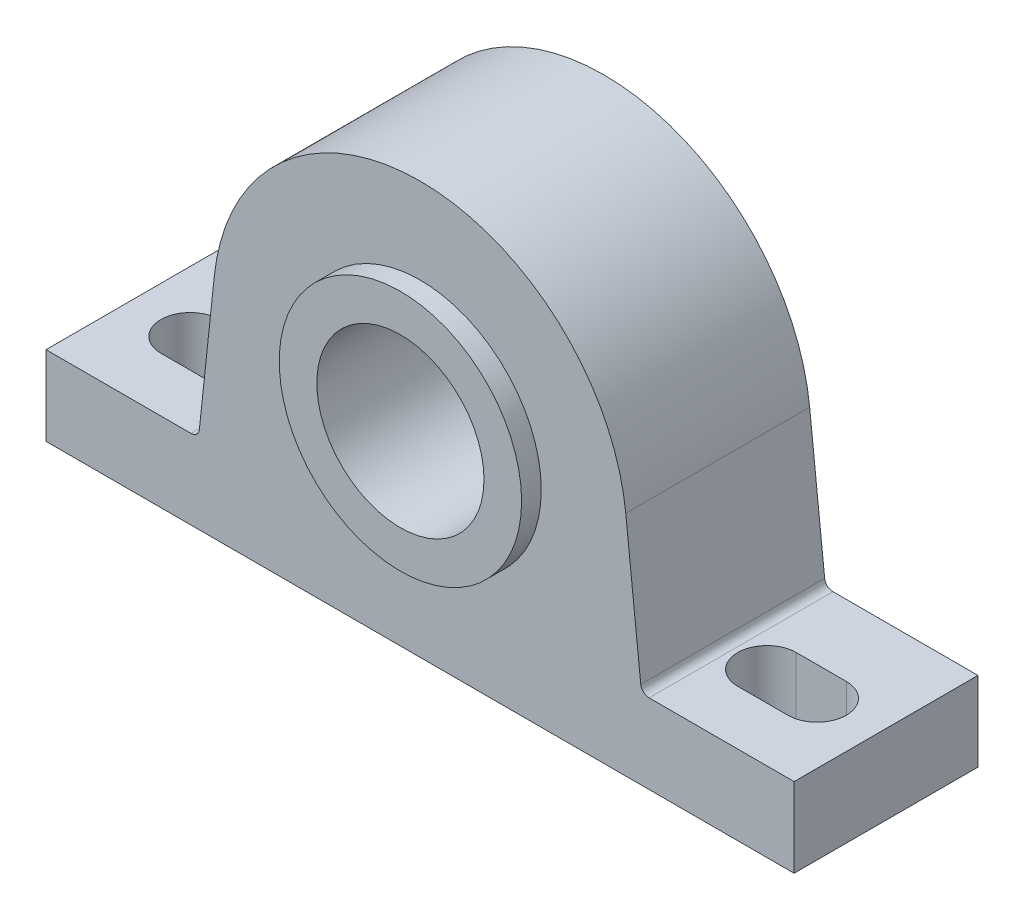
ISO-10303-21;
HEADER;
FILE_DESCRIPTION(('STEP AP214'),'2;1');
FILE_NAME('part.step','',(''),(''),'','','');
FILE_SCHEMA(('AUTOMOTIVE_DESIGN { 1 0 10303 214 1 1 1 1 }'));
ENDSEC;
DATA;
#1=APPLICATION_CONTEXT('core data for automotive mechanical design processes');
#2=APPLICATION_PROTOCOL_DEFINITION('international standard','automotive_design',2000,#1);
#3=PRODUCT_CONTEXT('',#1,'mechanical');
#4=PRODUCT('Part','Part','',(#3));
#5=PRODUCT_RELATED_PRODUCT_CATEGORY('part','',(#4));
#6=PRODUCT_DEFINITION_FORMATION('','',#4);
#7=PRODUCT_DEFINITION_CONTEXT('part definition',#1,'design');
#8=PRODUCT_DEFINITION('design','',#6,#7);
#9=PRODUCT_DEFINITION_SHAPE('','',#8);
#10=(LENGTH_UNIT() NAMED_UNIT(*) SI_UNIT(.MILLI.,.METRE.));
#11=(NAMED_UNIT(*) PLANE_ANGLE_UNIT() SI_UNIT($,.RADIAN.));
#12=(NAMED_UNIT(*) SI_UNIT($,.STERADIAN.) SOLID_ANGLE_UNIT());
#13=UNCERTAINTY_MEASURE_WITH_UNIT(LENGTH_MEASURE(1.E-05),#10,'distance_accuracy_value','');
#14=(GEOMETRIC_REPRESENTATION_CONTEXT(3) GLOBAL_UNCERTAINTY_ASSIGNED_CONTEXT((#13)) GLOBAL_UNIT_ASSIGNED_CONTEXT((#10,
#11,#12)) REPRESENTATION_CONTEXT('',''));
#15=CARTESIAN_POINT('',(0.,0.,0.));
#16=DIRECTION('',(0.,0.,1.));
#17=DIRECTION('',(1.,0.,0.));
#18=AXIS2_PLACEMENT_3D('',#15,#16,#17);
#19=CARTESIAN_POINT('',(0.,0.,0.));
#20=DIRECTION('',(0.,0.,1.));
#21=DIRECTION('',(1.,0.,0.));
#22=AXIS2_PLACEMENT_3D('',#19,#20,#21);
#23=PLANE('',#22);
#24=CARTESIAN_POINT('',(0.,0.,0.));
#25=DIRECTION('',(0.,0.,1.));
#26=DIRECTION('',(1.,0.,0.));
#27=AXIS2_PLACEMENT_3D('',#24,#25,#26);
#28=CIRCLE('',#27,49.4999997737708);
#29=CARTESIAN_POINT('',(49.220803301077,5.24999999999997,0.));
#30=VERTEX_POINT('',#29);
#31=CARTESIAN_POINT('',(-49.220803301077,5.24999999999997,0.));
#32=VERTEX_POINT('',#31);
#33=EDGE_CURVE('E248',#30,#32,#28,.T.);
#34=ORIENTED_EDGE('',*,*,#33,.T.);
#35=DIRECTION('',(-0.10600380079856,-0.994365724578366,0.));
#36=VECTOR('',#35,1.);
#37=CARTESIAN_POINT('',(-52.8091173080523,-28.4100803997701,0.));
#38=LINE('',#37,#36);
#39=CARTESIAN_POINT('',(-52.8091173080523,-28.4100803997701,0.));
#40=VERTEX_POINT('',#39);
#41=EDGE_CURVE('E245',#32,#40,#38,.T.);
#42=ORIENTED_EDGE('',*,*,#41,.T.);
#43=CARTESIAN_POINT('',(-54.797848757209,-28.198072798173,0.));
#44=DIRECTION('',(0.,0.,-1.));
#45=DIRECTION('',(-1.,0.,0.));
#46=AXIS2_PLACEMENT_3D('',#43,#44,#45);
#47=CIRCLE('',#46,1.99999999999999);
#48=CARTESIAN_POINT('',(-54.7979527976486,-30.1980727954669,0.));
#49=VERTEX_POINT('',#48);
#50=EDGE_CURVE('E242',#40,#49,#47,.T.);
#51=ORIENTED_EDGE('',*,*,#50,.T.);
#52=DIRECTION('',(-1.,0.,0.));
#53=VECTOR('',#52,1.);
#54=CARTESIAN_POINT('',(-89.5,-30.1980727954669,0.));
#55=LINE('',#54,#53);
#56=CARTESIAN_POINT('',(-89.5,-30.1980727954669,0.));
#57=VERTEX_POINT('',#56);
#58=EDGE_CURVE('E239',#49,#57,#55,.T.);
#59=ORIENTED_EDGE('',*,*,#58,.T.);
#60=DIRECTION('',(0.,-1.,0.));
#61=VECTOR('',#60,1.);
#62=CARTESIAN_POINT('',(-89.5,-49.2,0.));
#63=LINE('',#62,#61);
#64=CARTESIAN_POINT('',(-89.5,-49.2,0.));
#65=VERTEX_POINT('',#64);
#66=EDGE_CURVE('E236',#57,#65,#63,.T.);
#67=ORIENTED_EDGE('',*,*,#66,.T.);
#68=DIRECTION('',(1.,0.,0.));
#69=VECTOR('',#68,1.);
#70=CARTESIAN_POINT('',(-89.5,-49.2,0.));
#71=LINE('',#70,#69);
#72=CARTESIAN_POINT('',(89.5,-49.2,0.));
#73=VERTEX_POINT('',#72);
#74=EDGE_CURVE('E233',#65,#73,#71,.T.);
#75=ORIENTED_EDGE('',*,*,#74,.T.);
#76=DIRECTION('',(0.,1.,0.));
#77=VECTOR('',#76,1.);
#78=CARTESIAN_POINT('',(89.5,-49.2,0.));
#79=LINE('',#78,#77);
#80=CARTESIAN_POINT('',(89.5,-30.2,0.));
#81=VERTEX_POINT('',#80);
#82=EDGE_CURVE('E230',#73,#81,#79,.T.);
#83=ORIENTED_EDGE('',*,*,#82,.T.);
#84=DIRECTION('',(-1.,0.,0.));
#85=VECTOR('',#84,1.);
#86=CARTESIAN_POINT('',(89.5,-30.2,0.));
#87=LINE('',#86,#85);
#88=CARTESIAN_POINT('',(54.7981200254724,-30.2,0.));
#89=VERTEX_POINT('',#88);
#90=EDGE_CURVE('E227',#81,#89,#87,.T.);
#91=ORIENTED_EDGE('',*,*,#90,.T.);
#92=CARTESIAN_POINT('',(54.7981200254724,-28.2,0.));
#93=DIRECTION('',(0.,0.,-1.));
#94=DIRECTION('',(-1.,0.,0.));
#95=AXIS2_PLACEMENT_3D('',#92,#93,#94);
#96=CIRCLE('',#95,2.);
#97=CARTESIAN_POINT('',(52.8093889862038,-28.4120114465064,0.));
#98=VERTEX_POINT('',#97);
#99=EDGE_CURVE('E224',#89,#98,#96,.T.);
#100=ORIENTED_EDGE('',*,*,#99,.T.);
#101=DIRECTION('',(-0.106005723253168,0.994365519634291,0.));
#102=VECTOR('',#101,1.);
#103=CARTESIAN_POINT('',(52.8093889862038,-28.4120114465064,0.));
#104=LINE('',#103,#102);
#105=EDGE_CURVE('E221',#98,#30,#104,.T.);
#106=ORIENTED_EDGE('',*,*,#105,.T.);
#107=EDGE_LOOP('',(#34,#42,#51,#59,#67,#75,#83,#91,#100,#106));
#108=FACE_BOUND('',#107,.T.);
#109=CARTESIAN_POINT('',(0.,0.,0.));
#110=DIRECTION('',(0.,0.,1.));
#111=DIRECTION('',(1.,0.,0.));
#112=AXIS2_PLACEMENT_3D('',#109,#110,#111);
#113=CIRCLE('',#112,29.);
#114=CARTESIAN_POINT('',(29.,0.,0.));
#115=VERTEX_POINT('',#114);
#116=EDGE_CURVE('E297',#115,#115,#113,.T.);
#117=ORIENTED_EDGE('',*,*,#116,.F.);
#118=EDGE_LOOP('',(#117));
#119=FACE_BOUND('',#118,.T.);
#120=ADVANCED_FACE('F26',(#108,#119),#23,.T.);
#121=CARTESIAN_POINT('',(0.,0.,-44.));
#122=DIRECTION('',(0.,0.,1.));
#123=DIRECTION('',(1.,0.,0.));
#124=AXIS2_PLACEMENT_3D('',#121,#122,#123);
#125=CYLINDRICAL_SURFACE('',#124,49.4999997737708);
#126=ORIENTED_EDGE('',*,*,#33,.F.);
#127=DIRECTION('',(0.,0.,1.));
#128=VECTOR('',#127,1.);
#129=CARTESIAN_POINT('',(49.220803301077,5.24999999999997,-44.));
#130=LINE('',#129,#128);
#131=CARTESIAN_POINT('',(49.220803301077,5.24999999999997,-44.));
#132=VERTEX_POINT('',#131);
#133=EDGE_CURVE('E153',#132,#30,#130,.T.);
#134=ORIENTED_EDGE('',*,*,#133,.F.);
#135=CARTESIAN_POINT('',(0.,0.,-44.));
#136=DIRECTION('',(0.,0.,1.));
#137=DIRECTION('',(1.,0.,0.));
#138=AXIS2_PLACEMENT_3D('',#135,#136,#137);
#139=CIRCLE('',#138,49.4999997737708);
#140=CARTESIAN_POINT('',(-49.220803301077,5.24999999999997,-44.));
#141=VERTEX_POINT('',#140);
#142=EDGE_CURVE('E218',#132,#141,#139,.T.);
#143=ORIENTED_EDGE('',*,*,#142,.T.);
#144=DIRECTION('',(0.,0.,1.));
#145=VECTOR('',#144,1.);
#146=CARTESIAN_POINT('',(-49.220803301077,5.24999999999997,-44.));
#147=LINE('',#146,#145);
#148=EDGE_CURVE('E172',#141,#32,#147,.T.);
#149=ORIENTED_EDGE('',*,*,#148,.T.);
#150=EDGE_LOOP('',(#126,#134,#143,#149));
#151=FACE_BOUND('',#150,.T.);
#152=ADVANCED_FACE('F28',(#151),#125,.T.);
#153=CARTESIAN_POINT('',(52.8093889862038,-28.4120114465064,-44.));
#154=DIRECTION('',(0.994365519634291,0.106005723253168,0.));
#155=DIRECTION('',(-0.106005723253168,0.994365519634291,0.));
#156=AXIS2_PLACEMENT_3D('',#153,#154,#155);
#157=PLANE('',#156);
#158=ORIENTED_EDGE('',*,*,#105,.F.);
#159=DIRECTION('',(0.,0.,1.));
#160=VECTOR('',#159,1.);
#161=CARTESIAN_POINT('',(52.8093889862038,-28.4120114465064,-44.));
#162=LINE('',#161,#160);
#163=CARTESIAN_POINT('',(52.8093889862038,-28.4120114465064,-44.));
#164=VERTEX_POINT('',#163);
#165=EDGE_CURVE('E189',#164,#98,#162,.T.);
#166=ORIENTED_EDGE('',*,*,#165,.F.);
#167=DIRECTION('',(-0.106005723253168,0.994365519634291,0.));
#168=VECTOR('',#167,1.);
#169=CARTESIAN_POINT('',(52.8093889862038,-28.4120114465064,-44.));
#170=LINE('',#169,#168);
#171=EDGE_CURVE('E175',#164,#132,#170,.T.);
#172=ORIENTED_EDGE('',*,*,#171,.T.);
#173=ORIENTED_EDGE('',*,*,#133,.T.);
#174=EDGE_LOOP('',(#158,#166,#172,#173));
#175=FACE_BOUND('',#174,.T.);
#176=ADVANCED_FACE('F325',(#175),#157,.T.);
#177=CARTESIAN_POINT('',(54.7981200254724,-28.2,-44.));
#178=DIRECTION('',(0.,0.,1.));
#179=DIRECTION('',(1.,0.,0.));
#180=AXIS2_PLACEMENT_3D('',#177,#178,#179);
#181=CYLINDRICAL_SURFACE('',#180,2.);
#182=ORIENTED_EDGE('',*,*,#99,.F.);
#183=DIRECTION('',(0.,0.,1.));
#184=VECTOR('',#183,1.);
#185=CARTESIAN_POINT('',(54.7981200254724,-30.2,-44.));
#186=LINE('',#185,#184);
#187=CARTESIAN_POINT('',(54.7981200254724,-30.2,-44.));
#188=VERTEX_POINT('',#187);
#189=EDGE_CURVE('E187',#188,#89,#186,.T.);
#190=ORIENTED_EDGE('',*,*,#189,.F.);
#191=CARTESIAN_POINT('',(54.7981200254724,-28.2,-44.));
#192=DIRECTION('',(0.,0.,-1.));
#193=DIRECTION('',(-1.,0.,0.));
#194=AXIS2_PLACEMENT_3D('',#191,#192,#193);
#195=CIRCLE('',#194,2.);
#196=EDGE_CURVE('E194',#188,#164,#195,.T.);
#197=ORIENTED_EDGE('',*,*,#196,.T.);
#198=ORIENTED_EDGE('',*,*,#165,.T.);
#199=EDGE_LOOP('',(#182,#190,#197,#198));
#200=FACE_BOUND('',#199,.T.);
#201=ADVANCED_FACE('F338',(#200),#181,.F.);
#202=CARTESIAN_POINT('',(89.5,-30.2,-44.));
#203=DIRECTION('',(0.,1.,0.));
#204=DIRECTION('',(0.,0.,1.));
#205=AXIS2_PLACEMENT_3D('',#202,#203,#204);
#206=PLANE('',#205);
#207=CARTESIAN_POINT('',(63.,-30.2,-20.));
#208=DIRECTION('',(0.,1.,0.));
#209=DIRECTION('',(0.,0.,1.));
#210=AXIS2_PLACEMENT_3D('',#207,#208,#209);
#211=CIRCLE('',#210,7.);
#212=CARTESIAN_POINT('',(63.,-30.2,-27.));
#213=VERTEX_POINT('',#212);
#214=CARTESIAN_POINT('',(63.,-30.2,-13.));
#215=VERTEX_POINT('',#214);
#216=EDGE_CURVE('E160',#213,#215,#211,.T.);
#217=ORIENTED_EDGE('',*,*,#216,.F.);
#218=DIRECTION('',(-1.,0.,0.));
#219=VECTOR('',#218,1.);
#220=CARTESIAN_POINT('',(89.5,-30.2,-27.));
#221=LINE('',#220,#219);
#222=CARTESIAN_POINT('',(75.,-30.2,-27.));
#223=VERTEX_POINT('',#222);
#224=EDGE_CURVE('E284',#223,#213,#221,.T.);
#225=ORIENTED_EDGE('',*,*,#224,.F.);
#226=CARTESIAN_POINT('',(75.,-30.2,-20.));
#227=DIRECTION('',(0.,1.,0.));
#228=DIRECTION('',(0.,0.,1.));
#229=AXIS2_PLACEMENT_3D('',#226,#227,#228);
#230=CIRCLE('',#229,7.);
#231=CARTESIAN_POINT('',(75.,-30.2,-13.));
#232=VERTEX_POINT('',#231);
#233=EDGE_CURVE('E286',#232,#223,#230,.T.);
#234=ORIENTED_EDGE('',*,*,#233,.F.);
#235=DIRECTION('',(1.,0.,0.));
#236=VECTOR('',#235,1.);
#237=CARTESIAN_POINT('',(89.5,-30.2,-13.));
#238=LINE('',#237,#236);
#239=EDGE_CURVE('E288',#215,#232,#238,.T.);
#240=ORIENTED_EDGE('',*,*,#239,.F.);
#241=EDGE_LOOP('',(#217,#225,#234,#240));
#242=FACE_BOUND('',#241,.T.);
#243=ORIENTED_EDGE('',*,*,#90,.F.);
#244=DIRECTION('',(0.,0.,1.));
#245=VECTOR('',#244,1.);
#246=CARTESIAN_POINT('',(89.5,-30.2,-44.));
#247=LINE('',#246,#245);
#248=CARTESIAN_POINT('',(89.5,-30.2,-44.));
#249=VERTEX_POINT('',#248);
#250=EDGE_CURVE('E185',#249,#81,#247,.T.);
#251=ORIENTED_EDGE('',*,*,#250,.F.);
#252=DIRECTION('',(-1.,0.,0.));
#253=VECTOR('',#252,1.);
#254=CARTESIAN_POINT('',(89.5,-30.2,-44.));
#255=LINE('',#254,#253);
#256=EDGE_CURVE('E197',#249,#188,#255,.T.);
#257=ORIENTED_EDGE('',*,*,#256,.T.);
#258=ORIENTED_EDGE('',*,*,#189,.T.);
#259=EDGE_LOOP('',(#243,#251,#257,#258));
#260=FACE_BOUND('',#259,.T.);
#261=ADVANCED_FACE('F342',(#242,#260),#206,.T.);
#262=CARTESIAN_POINT('',(89.5,-49.2,-44.));
#263=DIRECTION('',(1.,0.,0.));
#264=DIRECTION('',(0.,0.,-1.));
#265=AXIS2_PLACEMENT_3D('',#262,#263,#264);
#266=PLANE('',#265);
#267=ORIENTED_EDGE('',*,*,#82,.F.);
#268=DIRECTION('',(0.,0.,1.));
#269=VECTOR('',#268,1.);
#270=CARTESIAN_POINT('',(89.5,-49.2,-44.));
#271=LINE('',#270,#269);
#272=CARTESIAN_POINT('',(89.5,-49.2,-44.));
#273=VERTEX_POINT('',#272);
#274=EDGE_CURVE('E183',#273,#73,#271,.T.);
#275=ORIENTED_EDGE('',*,*,#274,.F.);
#276=DIRECTION('',(0.,1.,0.));
#277=VECTOR('',#276,1.);
#278=CARTESIAN_POINT('',(89.5,-49.2,-44.));
#279=LINE('',#278,#277);
#280=EDGE_CURVE('E200',#273,#249,#279,.T.);
#281=ORIENTED_EDGE('',*,*,#280,.T.);
#282=ORIENTED_EDGE('',*,*,#250,.T.);
#283=EDGE_LOOP('',(#267,#275,#281,#282));
#284=FACE_BOUND('',#283,.T.);
#285=ADVANCED_FACE('F346',(#284),#266,.T.);
#286=CARTESIAN_POINT('',(-89.5,-49.2,-44.));
#287=DIRECTION('',(0.,-1.,0.));
#288=DIRECTION('',(0.,0.,-1.));
#289=AXIS2_PLACEMENT_3D('',#286,#287,#288);
#290=PLANE('',#289);
#291=CARTESIAN_POINT('',(63.,-49.2,-20.));
#292=DIRECTION('',(0.,-1.,0.));
#293=DIRECTION('',(0.,0.,-1.));
#294=AXIS2_PLACEMENT_3D('',#291,#292,#293);
#295=CIRCLE('',#294,7.);
#296=CARTESIAN_POINT('',(63.,-49.2,-13.));
#297=VERTEX_POINT('',#296);
#298=CARTESIAN_POINT('',(63.,-49.2,-27.));
#299=VERTEX_POINT('',#298);
#300=EDGE_CURVE('E11',#297,#299,#295,.T.);
#301=ORIENTED_EDGE('',*,*,#300,.F.);
#302=DIRECTION('',(-1.,0.,0.));
#303=VECTOR('',#302,1.);
#304=CARTESIAN_POINT('',(-89.5,-49.2,-13.));
#305=LINE('',#304,#303);
#306=CARTESIAN_POINT('',(75.,-49.2,-13.));
#307=VERTEX_POINT('',#306);
#308=EDGE_CURVE('E147',#307,#297,#305,.T.);
#309=ORIENTED_EDGE('',*,*,#308,.F.);
#310=CARTESIAN_POINT('',(75.,-49.2,-20.));
#311=DIRECTION('',(0.,-1.,0.));
#312=DIRECTION('',(0.,0.,-1.));
#313=AXIS2_PLACEMENT_3D('',#310,#311,#312);
#314=CIRCLE('',#313,7.);
#315=CARTESIAN_POINT('',(75.,-49.2,-27.));
#316=VERTEX_POINT('',#315);
#317=EDGE_CURVE('E152',#316,#307,#314,.T.);
#318=ORIENTED_EDGE('',*,*,#317,.F.);
#319=DIRECTION('',(1.,0.,0.));
#320=VECTOR('',#319,1.);
#321=CARTESIAN_POINT('',(-89.5,-49.2,-27.));
#322=LINE('',#321,#320);
#323=EDGE_CURVE('E34',#299,#316,#322,.T.);
#324=ORIENTED_EDGE('',*,*,#323,.F.);
#325=EDGE_LOOP('',(#301,#309,#318,#324));
#326=FACE_BOUND('',#325,.T.);
#327=CARTESIAN_POINT('',(-75.,-49.2,-20.));
#328=DIRECTION('',(0.,-1.,0.));
#329=DIRECTION('',(0.,0.,-1.));
#330=AXIS2_PLACEMENT_3D('',#327,#328,#329);
#331=CIRCLE('',#330,6.99999999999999);
#332=CARTESIAN_POINT('',(-75.,-49.2,-13.));
#333=VERTEX_POINT('',#332);
#334=CARTESIAN_POINT('',(-75.,-49.2,-27.));
#335=VERTEX_POINT('',#334);
#336=EDGE_CURVE('E254',#333,#335,#331,.T.);
#337=ORIENTED_EDGE('',*,*,#336,.F.);
#338=DIRECTION('',(-1.,0.,0.));
#339=VECTOR('',#338,1.);
#340=CARTESIAN_POINT('',(-89.5,-49.2,-13.));
#341=LINE('',#340,#339);
#342=CARTESIAN_POINT('',(-63.,-49.2,-13.));
#343=VERTEX_POINT('',#342);
#344=EDGE_CURVE('E261',#343,#333,#341,.T.);
#345=ORIENTED_EDGE('',*,*,#344,.F.);
#346=CARTESIAN_POINT('',(-63.,-49.2,-20.));
#347=DIRECTION('',(0.,-1.,0.));
#348=DIRECTION('',(0.,0.,-1.));
#349=AXIS2_PLACEMENT_3D('',#346,#347,#348);
#350=CIRCLE('',#349,6.99999999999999);
#351=CARTESIAN_POINT('',(-63.,-49.2,-27.));
#352=VERTEX_POINT('',#351);
#353=EDGE_CURVE('E258',#352,#343,#350,.T.);
#354=ORIENTED_EDGE('',*,*,#353,.F.);
#355=DIRECTION('',(1.,0.,0.));
#356=VECTOR('',#355,1.);
#357=CARTESIAN_POINT('',(-89.5,-49.2,-27.));
#358=LINE('',#357,#356);
#359=EDGE_CURVE('E256',#335,#352,#358,.T.);
#360=ORIENTED_EDGE('',*,*,#359,.F.);
#361=EDGE_LOOP('',(#337,#345,#354,#360));
#362=FACE_BOUND('',#361,.T.);
#363=ORIENTED_EDGE('',*,*,#74,.F.);
#364=DIRECTION('',(0.,0.,1.));
#365=VECTOR('',#364,1.);
#366=CARTESIAN_POINT('',(-89.5,-49.2,-44.));
#367=LINE('',#366,#365);
#368=CARTESIAN_POINT('',(-89.5,-49.2,-44.));
#369=VERTEX_POINT('',#368);
#370=EDGE_CURVE('E181',#369,#65,#367,.T.);
#371=ORIENTED_EDGE('',*,*,#370,.F.);
#372=DIRECTION('',(1.,0.,0.));
#373=VECTOR('',#372,1.);
#374=CARTESIAN_POINT('',(-89.5,-49.2,-44.));
#375=LINE('',#374,#373);
#376=EDGE_CURVE('E203',#369,#273,#375,.T.);
#377=ORIENTED_EDGE('',*,*,#376,.T.);
#378=ORIENTED_EDGE('',*,*,#274,.T.);
#379=EDGE_LOOP('',(#363,#371,#377,#378));
#380=FACE_BOUND('',#379,.T.);
#381=ADVANCED_FACE('F165',(#326,#362,#380),#290,.T.);
#382=CARTESIAN_POINT('',(-89.5,-49.2,-44.));
#383=DIRECTION('',(-1.,0.,0.));
#384=DIRECTION('',(0.,0.,1.));
#385=AXIS2_PLACEMENT_3D('',#382,#383,#384);
#386=PLANE('',#385);
#387=ORIENTED_EDGE('',*,*,#66,.F.);
#388=DIRECTION('',(0.,0.,1.));
#389=VECTOR('',#388,1.);
#390=CARTESIAN_POINT('',(-89.5,-30.1980727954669,-44.));
#391=LINE('',#390,#389);
#392=CARTESIAN_POINT('',(-89.5,-30.1980727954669,-44.));
#393=VERTEX_POINT('',#392);
#394=EDGE_CURVE('E179',#393,#57,#391,.T.);
#395=ORIENTED_EDGE('',*,*,#394,.F.);
#396=DIRECTION('',(0.,-1.,0.));
#397=VECTOR('',#396,1.);
#398=CARTESIAN_POINT('',(-89.5,-49.2,-44.));
#399=LINE('',#398,#397);
#400=EDGE_CURVE('E206',#393,#369,#399,.T.);
#401=ORIENTED_EDGE('',*,*,#400,.T.);
#402=ORIENTED_EDGE('',*,*,#370,.T.);
#403=EDGE_LOOP('',(#387,#395,#401,#402));
#404=FACE_BOUND('',#403,.T.);
#405=ADVANCED_FACE('F353',(#404),#386,.T.);
#406=CARTESIAN_POINT('',(-89.5,-30.1980727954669,-44.));
#407=DIRECTION('',(0.,1.,0.));
#408=DIRECTION('',(0.,0.,1.));
#409=AXIS2_PLACEMENT_3D('',#406,#407,#408);
#410=PLANE('',#409);
#411=CARTESIAN_POINT('',(-75.,-30.1980727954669,-20.));
#412=DIRECTION('',(0.,1.,0.));
#413=DIRECTION('',(0.,0.,1.));
#414=AXIS2_PLACEMENT_3D('',#411,#412,#413);
#415=CIRCLE('',#414,6.99999999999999);
#416=CARTESIAN_POINT('',(-75.,-30.1980727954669,-27.));
#417=VERTEX_POINT('',#416);
#418=CARTESIAN_POINT('',(-75.,-30.1980727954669,-13.));
#419=VERTEX_POINT('',#418);
#420=EDGE_CURVE('E281',#417,#419,#415,.T.);
#421=ORIENTED_EDGE('',*,*,#420,.F.);
#422=DIRECTION('',(-1.,0.,0.));
#423=VECTOR('',#422,1.);
#424=CARTESIAN_POINT('',(-75.,-30.1980727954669,-27.));
#425=LINE('',#424,#423);
#426=CARTESIAN_POINT('',(-63.,-30.1980727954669,-27.));
#427=VERTEX_POINT('',#426);
#428=EDGE_CURVE('E268',#427,#417,#425,.T.);
#429=ORIENTED_EDGE('',*,*,#428,.F.);
#430=CARTESIAN_POINT('',(-63.,-30.1980727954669,-20.));
#431=DIRECTION('',(0.,1.,0.));
#432=DIRECTION('',(0.,0.,-1.));
#433=AXIS2_PLACEMENT_3D('',#430,#431,#432);
#434=CIRCLE('',#433,6.99999999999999);
#435=CARTESIAN_POINT('',(-63.,-30.1980727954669,-13.));
#436=VERTEX_POINT('',#435);
#437=EDGE_CURVE('E275',#436,#427,#434,.T.);
#438=ORIENTED_EDGE('',*,*,#437,.F.);
#439=DIRECTION('',(1.,0.,0.));
#440=VECTOR('',#439,1.);
#441=CARTESIAN_POINT('',(-75.,-30.1980727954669,-13.));
#442=LINE('',#441,#440);
#443=EDGE_CURVE('E278',#419,#436,#442,.T.);
#444=ORIENTED_EDGE('',*,*,#443,.F.);
#445=EDGE_LOOP('',(#421,#429,#438,#444));
#446=FACE_BOUND('',#445,.T.);
#447=ORIENTED_EDGE('',*,*,#58,.F.);
#448=DIRECTION('',(0.,0.,1.));
#449=VECTOR('',#448,1.);
#450=CARTESIAN_POINT('',(-54.7979527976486,-30.1980727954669,-44.));
#451=LINE('',#450,#449);
#452=CARTESIAN_POINT('',(-54.7979527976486,-30.1980727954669,-44.));
#453=VERTEX_POINT('',#452);
#454=EDGE_CURVE('E177',#453,#49,#451,.T.);
#455=ORIENTED_EDGE('',*,*,#454,.F.);
#456=DIRECTION('',(-1.,0.,0.));
#457=VECTOR('',#456,1.);
#458=CARTESIAN_POINT('',(-89.5,-30.1980727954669,-44.));
#459=LINE('',#458,#457);
#460=EDGE_CURVE('E209',#453,#393,#459,.T.);
#461=ORIENTED_EDGE('',*,*,#460,.T.);
#462=ORIENTED_EDGE('',*,*,#394,.T.);
#463=EDGE_LOOP('',(#447,#455,#461,#462));
#464=FACE_BOUND('',#463,.T.);
#465=ADVANCED_FACE('F356',(#446,#464),#410,.T.);
#466=CARTESIAN_POINT('',(-54.797848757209,-28.198072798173,-44.));
#467=DIRECTION('',(0.,0.,1.));
#468=DIRECTION('',(1.,0.,0.));
#469=AXIS2_PLACEMENT_3D('',#466,#467,#468);
#470=CYLINDRICAL_SURFACE('',#469,1.99999999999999);
#471=ORIENTED_EDGE('',*,*,#50,.F.);
#472=DIRECTION('',(0.,0.,1.));
#473=VECTOR('',#472,1.);
#474=CARTESIAN_POINT('',(-52.8091173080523,-28.4100803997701,-44.));
#475=LINE('',#474,#473);
#476=CARTESIAN_POINT('',(-52.8091173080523,-28.4100803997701,-44.));
#477=VERTEX_POINT('',#476);
#478=EDGE_CURVE('E174',#477,#40,#475,.T.);
#479=ORIENTED_EDGE('',*,*,#478,.F.);
#480=CARTESIAN_POINT('',(-54.797848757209,-28.198072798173,-44.));
#481=DIRECTION('',(0.,0.,-1.));
#482=DIRECTION('',(-1.,0.,0.));
#483=AXIS2_PLACEMENT_3D('',#480,#481,#482);
#484=CIRCLE('',#483,1.99999999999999);
#485=EDGE_CURVE('E212',#477,#453,#484,.T.);
#486=ORIENTED_EDGE('',*,*,#485,.T.);
#487=ORIENTED_EDGE('',*,*,#454,.T.);
#488=EDGE_LOOP('',(#471,#479,#486,#487));
#489=FACE_BOUND('',#488,.T.);
#490=ADVANCED_FACE('F360',(#489),#470,.F.);
#491=CARTESIAN_POINT('',(-52.8091173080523,-28.4100803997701,-44.));
#492=DIRECTION('',(-0.994365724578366,0.10600380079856,0.));
#493=DIRECTION('',(-0.10600380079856,-0.994365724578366,0.));
#494=AXIS2_PLACEMENT_3D('',#491,#492,#493);
#495=PLANE('',#494);
#496=ORIENTED_EDGE('',*,*,#41,.F.);
#497=ORIENTED_EDGE('',*,*,#148,.F.);
#498=DIRECTION('',(-0.10600380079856,-0.994365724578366,0.));
#499=VECTOR('',#498,1.);
#500=CARTESIAN_POINT('',(-52.8091173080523,-28.4100803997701,-44.));
#501=LINE('',#500,#499);
#502=EDGE_CURVE('E215',#141,#477,#501,.T.);
#503=ORIENTED_EDGE('',*,*,#502,.T.);
#504=ORIENTED_EDGE('',*,*,#478,.T.);
#505=EDGE_LOOP('',(#496,#497,#503,#504));
#506=FACE_BOUND('',#505,.T.);
#507=ADVANCED_FACE('F334',(#506),#495,.T.);
#508=CARTESIAN_POINT('',(0.,0.,-44.));
#509=DIRECTION('',(0.,0.,1.));
#510=DIRECTION('',(1.,0.,0.));
#511=AXIS2_PLACEMENT_3D('',#508,#509,#510);
#512=PLANE('',#511);
#513=CARTESIAN_POINT('',(0.,0.,-44.));
#514=DIRECTION('',(0.,0.,1.));
#515=DIRECTION('',(1.,0.,0.));
#516=AXIS2_PLACEMENT_3D('',#513,#514,#515);
#517=CIRCLE('',#516,20.);
#518=CARTESIAN_POINT('',(20.,0.,-44.));
#519=VERTEX_POINT('',#518);
#520=EDGE_CURVE('E251',#519,#519,#517,.T.);
#521=ORIENTED_EDGE('',*,*,#520,.T.);
#522=EDGE_LOOP('',(#521));
#523=FACE_BOUND('',#522,.T.);
#524=ORIENTED_EDGE('',*,*,#142,.F.);
#525=ORIENTED_EDGE('',*,*,#171,.F.);
#526=ORIENTED_EDGE('',*,*,#196,.F.);
#527=ORIENTED_EDGE('',*,*,#256,.F.);
#528=ORIENTED_EDGE('',*,*,#280,.F.);
#529=ORIENTED_EDGE('',*,*,#376,.F.);
#530=ORIENTED_EDGE('',*,*,#400,.F.);
#531=ORIENTED_EDGE('',*,*,#460,.F.);
#532=ORIENTED_EDGE('',*,*,#485,.F.);
#533=ORIENTED_EDGE('',*,*,#502,.F.);
#534=EDGE_LOOP('',(#524,#525,#526,#527,#528,#529,#530,#531,#532,#533));
#535=FACE_BOUND('',#534,.T.);
#536=ADVANCED_FACE('F331',(#523,#535),#512,.F.);
#537=CARTESIAN_POINT('',(0.,0.,-44.));
#538=DIRECTION('',(0.,0.,1.));
#539=DIRECTION('',(1.,0.,0.));
#540=AXIS2_PLACEMENT_3D('',#537,#538,#539);
#541=CYLINDRICAL_SURFACE('',#540,20.);
#542=ORIENTED_EDGE('',*,*,#520,.F.);
#543=EDGE_LOOP('',(#542));
#544=FACE_BOUND('',#543,.T.);
#545=CARTESIAN_POINT('',(0.,0.,4.7));
#546=DIRECTION('',(0.,0.,1.));
#547=DIRECTION('',(1.,0.,0.));
#548=AXIS2_PLACEMENT_3D('',#545,#546,#547);
#549=CIRCLE('',#548,20.);
#550=CARTESIAN_POINT('',(20.,0.,4.7));
#551=VERTEX_POINT('',#550);
#552=EDGE_CURVE('E300',#551,#551,#549,.T.);
#553=ORIENTED_EDGE('',*,*,#552,.T.);
#554=EDGE_LOOP('',(#553));
#555=FACE_BOUND('',#554,.T.);
#556=ADVANCED_FACE('F304',(#544,#555),#541,.F.);
#557=CARTESIAN_POINT('',(-75.,-74.1980727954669,-20.));
#558=DIRECTION('',(0.,1.,0.));
#559=DIRECTION('',(0.,0.,1.));
#560=AXIS2_PLACEMENT_3D('',#557,#558,#559);
#561=CYLINDRICAL_SURFACE('',#560,6.99999999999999);
#562=ORIENTED_EDGE('',*,*,#336,.T.);
#563=DIRECTION('',(0.,1.,0.));
#564=VECTOR('',#563,1.);
#565=CARTESIAN_POINT('',(-75.,-74.1980727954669,-27.));
#566=LINE('',#565,#564);
#567=EDGE_CURVE('E263',#335,#417,#566,.T.);
#568=ORIENTED_EDGE('',*,*,#567,.T.);
#569=ORIENTED_EDGE('',*,*,#420,.T.);
#570=DIRECTION('',(0.,1.,0.));
#571=VECTOR('',#570,1.);
#572=CARTESIAN_POINT('',(-75.,-74.1980727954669,-13.));
#573=LINE('',#572,#571);
#574=EDGE_CURVE('E264',#333,#419,#573,.T.);
#575=ORIENTED_EDGE('',*,*,#574,.F.);
#576=EDGE_LOOP('',(#562,#568,#569,#575));
#577=FACE_BOUND('',#576,.T.);
#578=ADVANCED_FACE('F405',(#577),#561,.F.);
#579=CARTESIAN_POINT('',(-75.,-74.1980727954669,-27.));
#580=DIRECTION('',(0.,0.,-1.));
#581=DIRECTION('',(-1.,0.,0.));
#582=AXIS2_PLACEMENT_3D('',#579,#580,#581);
#583=PLANE('',#582);
#584=ORIENTED_EDGE('',*,*,#359,.T.);
#585=DIRECTION('',(0.,1.,0.));
#586=VECTOR('',#585,1.);
#587=CARTESIAN_POINT('',(-63.,-74.1980727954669,-27.));
#588=LINE('',#587,#586);
#589=EDGE_CURVE('E270',#352,#427,#588,.T.);
#590=ORIENTED_EDGE('',*,*,#589,.T.);
#591=ORIENTED_EDGE('',*,*,#428,.T.);
#592=ORIENTED_EDGE('',*,*,#567,.F.);
#593=EDGE_LOOP('',(#584,#590,#591,#592));
#594=FACE_BOUND('',#593,.T.);
#595=ADVANCED_FACE('F412',(#594),#583,.F.);
#596=CARTESIAN_POINT('',(-63.,-74.1980727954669,-20.));
#597=DIRECTION('',(0.,1.,0.));
#598=DIRECTION('',(0.,0.,1.));
#599=AXIS2_PLACEMENT_3D('',#596,#597,#598);
#600=CYLINDRICAL_SURFACE('',#599,6.99999999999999);
#601=ORIENTED_EDGE('',*,*,#353,.T.);
#602=DIRECTION('',(0.,1.,0.));
#603=VECTOR('',#602,1.);
#604=CARTESIAN_POINT('',(-63.,-74.1980727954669,-13.));
#605=LINE('',#604,#603);
#606=EDGE_CURVE('E267',#343,#436,#605,.T.);
#607=ORIENTED_EDGE('',*,*,#606,.T.);
#608=ORIENTED_EDGE('',*,*,#437,.T.);
#609=ORIENTED_EDGE('',*,*,#589,.F.);
#610=EDGE_LOOP('',(#601,#607,#608,#609));
#611=FACE_BOUND('',#610,.T.);
#612=ADVANCED_FACE('F419',(#611),#600,.F.);
#613=CARTESIAN_POINT('',(-75.,-74.1980727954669,-13.));
#614=DIRECTION('',(0.,0.,1.));
#615=DIRECTION('',(1.,0.,0.));
#616=AXIS2_PLACEMENT_3D('',#613,#614,#615);
#617=PLANE('',#616);
#618=ORIENTED_EDGE('',*,*,#344,.T.);
#619=ORIENTED_EDGE('',*,*,#574,.T.);
#620=ORIENTED_EDGE('',*,*,#443,.T.);
#621=ORIENTED_EDGE('',*,*,#606,.F.);
#622=EDGE_LOOP('',(#618,#619,#620,#621));
#623=FACE_BOUND('',#622,.T.);
#624=ADVANCED_FACE('F427',(#623),#617,.F.);
#625=CARTESIAN_POINT('',(63.,-74.1980727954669,-20.));
#626=DIRECTION('',(0.,1.,0.));
#627=DIRECTION('',(0.,0.,1.));
#628=AXIS2_PLACEMENT_3D('',#625,#626,#627);
#629=CYLINDRICAL_SURFACE('',#628,7.);
#630=ORIENTED_EDGE('',*,*,#216,.T.);
#631=DIRECTION('',(0.,1.,0.));
#632=VECTOR('',#631,1.);
#633=CARTESIAN_POINT('',(63.,-74.1980727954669,-13.));
#634=LINE('',#633,#632);
#635=EDGE_CURVE('E41',#297,#215,#634,.T.);
#636=ORIENTED_EDGE('',*,*,#635,.F.);
#637=ORIENTED_EDGE('',*,*,#300,.T.);
#638=DIRECTION('',(0.,1.,0.));
#639=VECTOR('',#638,1.);
#640=CARTESIAN_POINT('',(63.,-74.1980727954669,-27.));
#641=LINE('',#640,#639);
#642=EDGE_CURVE('E289',#299,#213,#641,.T.);
#643=ORIENTED_EDGE('',*,*,#642,.T.);
#644=EDGE_LOOP('',(#630,#636,#637,#643));
#645=FACE_BOUND('',#644,.T.);
#646=ADVANCED_FACE('F156',(#645),#629,.F.);
#647=CARTESIAN_POINT('',(63.,-74.1980727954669,-27.));
#648=DIRECTION('',(0.,0.,-1.));
#649=DIRECTION('',(-1.,0.,0.));
#650=AXIS2_PLACEMENT_3D('',#647,#648,#649);
#651=PLANE('',#650);
#652=ORIENTED_EDGE('',*,*,#224,.T.);
#653=ORIENTED_EDGE('',*,*,#642,.F.);
#654=ORIENTED_EDGE('',*,*,#323,.T.);
#655=DIRECTION('',(0.,1.,0.));
#656=VECTOR('',#655,1.);
#657=CARTESIAN_POINT('',(75.,-74.1980727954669,-27.));
#658=LINE('',#657,#656);
#659=EDGE_CURVE('E292',#316,#223,#658,.T.);
#660=ORIENTED_EDGE('',*,*,#659,.T.);
#661=EDGE_LOOP('',(#652,#653,#654,#660));
#662=FACE_BOUND('',#661,.T.);
#663=ADVANCED_FACE('F442',(#662),#651,.F.);
#664=CARTESIAN_POINT('',(75.,-74.1980727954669,-20.));
#665=DIRECTION('',(0.,1.,0.));
#666=DIRECTION('',(0.,0.,1.));
#667=AXIS2_PLACEMENT_3D('',#664,#665,#666);
#668=CYLINDRICAL_SURFACE('',#667,7.);
#669=ORIENTED_EDGE('',*,*,#233,.T.);
#670=ORIENTED_EDGE('',*,*,#659,.F.);
#671=ORIENTED_EDGE('',*,*,#317,.T.);
#672=DIRECTION('',(0.,1.,0.));
#673=VECTOR('',#672,1.);
#674=CARTESIAN_POINT('',(75.,-74.1980727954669,-13.));
#675=LINE('',#674,#673);
#676=EDGE_CURVE('E46',#307,#232,#675,.T.);
#677=ORIENTED_EDGE('',*,*,#676,.T.);
#678=EDGE_LOOP('',(#669,#670,#671,#677));
#679=FACE_BOUND('',#678,.T.);
#680=ADVANCED_FACE('F317',(#679),#668,.F.);
#681=CARTESIAN_POINT('',(75.,-74.1980727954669,-13.));
#682=DIRECTION('',(0.,0.,1.));
#683=DIRECTION('',(1.,0.,0.));
#684=AXIS2_PLACEMENT_3D('',#681,#682,#683);
#685=PLANE('',#684);
#686=ORIENTED_EDGE('',*,*,#239,.T.);
#687=ORIENTED_EDGE('',*,*,#676,.F.);
#688=ORIENTED_EDGE('',*,*,#308,.T.);
#689=ORIENTED_EDGE('',*,*,#635,.T.);
#690=EDGE_LOOP('',(#686,#687,#688,#689));
#691=FACE_BOUND('',#690,.T.);
#692=ADVANCED_FACE('F148',(#691),#685,.F.);
#693=CARTESIAN_POINT('',(0.,0.,4.7));
#694=DIRECTION('',(0.,0.,1.));
#695=DIRECTION('',(1.,0.,0.));
#696=AXIS2_PLACEMENT_3D('',#693,#694,#695);
#697=PLANE('',#696);
#698=CARTESIAN_POINT('',(0.,0.,4.7));
#699=DIRECTION('',(0.,0.,1.));
#700=DIRECTION('',(1.,0.,0.));
#701=AXIS2_PLACEMENT_3D('',#698,#699,#700);
#702=CIRCLE('',#701,29.);
#703=CARTESIAN_POINT('',(29.,0.,4.7));
#704=VERTEX_POINT('',#703);
#705=EDGE_CURVE('E162',#704,#704,#702,.T.);
#706=ORIENTED_EDGE('',*,*,#705,.T.);
#707=EDGE_LOOP('',(#706));
#708=FACE_BOUND('',#707,.T.);
#709=ORIENTED_EDGE('',*,*,#552,.F.);
#710=EDGE_LOOP('',(#709));
#711=FACE_BOUND('',#710,.T.);
#712=ADVANCED_FACE('F306',(#708,#711),#697,.T.);
#713=CARTESIAN_POINT('',(0.,0.,4.7));
#714=DIRECTION('',(0.,0.,-1.));
#715=DIRECTION('',(-1.,0.,0.));
#716=AXIS2_PLACEMENT_3D('',#713,#714,#715);
#717=CYLINDRICAL_SURFACE('',#716,29.);
#718=ORIENTED_EDGE('',*,*,#705,.F.);
#719=EDGE_LOOP('',(#718));
#720=FACE_BOUND('',#719,.T.);
#721=ORIENTED_EDGE('',*,*,#116,.T.);
#722=EDGE_LOOP('',(#721));
#723=FACE_BOUND('',#722,.T.);
#724=ADVANCED_FACE('F308',(#720,#723),#717,.T.);
#725=CLOSED_SHELL('',(#120,#152,#176,#201,#261,#285,#381,#405,#465,#490,#507,#536,#556,#578,
#595,#612,#624,#646,#663,#680,#692,#712,#724));
#726=MANIFOLD_SOLID_BREP('B2',#725);
#727=ADVANCED_BREP_SHAPE_REPRESENTATION('',(#18,#726),#14);
#728=SHAPE_DEFINITION_REPRESENTATION(#9,#727);
ENDSEC;
END-ISO-10303-21;
